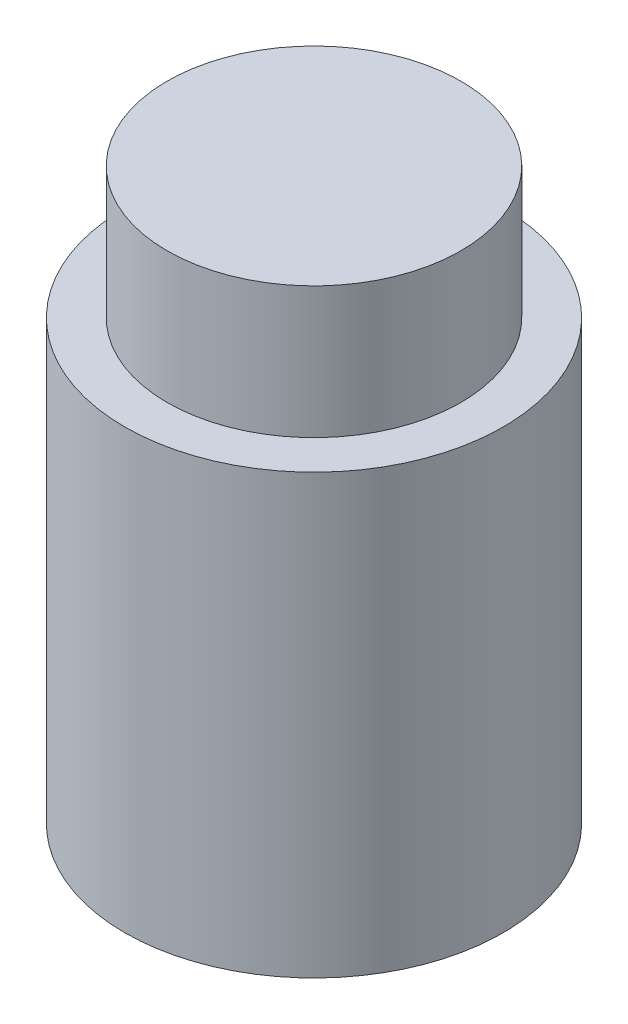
ISO-10303-21;
HEADER;
FILE_DESCRIPTION(('STEP AP214'),'2;1');
FILE_NAME('part.step','',(''),(''),'','','');
FILE_SCHEMA(('AUTOMOTIVE_DESIGN { 1 0 10303 214 1 1 1 1 }'));
ENDSEC;
DATA;
#1=APPLICATION_CONTEXT('core data for automotive mechanical design processes');
#2=APPLICATION_PROTOCOL_DEFINITION('international standard','automotive_design',2000,#1);
#3=PRODUCT_CONTEXT('',#1,'mechanical');
#4=PRODUCT('Part','Part','',(#3));
#5=PRODUCT_RELATED_PRODUCT_CATEGORY('part','',(#4));
#6=PRODUCT_DEFINITION_FORMATION('','',#4);
#7=PRODUCT_DEFINITION_CONTEXT('part definition',#1,'design');
#8=PRODUCT_DEFINITION('design','',#6,#7);
#9=PRODUCT_DEFINITION_SHAPE('','',#8);
#10=(LENGTH_UNIT() NAMED_UNIT(*) SI_UNIT(.MILLI.,.METRE.));
#11=(NAMED_UNIT(*) PLANE_ANGLE_UNIT() SI_UNIT($,.RADIAN.));
#12=(NAMED_UNIT(*) SI_UNIT($,.STERADIAN.) SOLID_ANGLE_UNIT());
#13=UNCERTAINTY_MEASURE_WITH_UNIT(LENGTH_MEASURE(1.E-05),#10,'distance_accuracy_value','');
#14=(GEOMETRIC_REPRESENTATION_CONTEXT(3) GLOBAL_UNCERTAINTY_ASSIGNED_CONTEXT((#13)) GLOBAL_UNIT_ASSIGNED_CONTEXT((#10,
#11,#12)) REPRESENTATION_CONTEXT('',''));
#15=CARTESIAN_POINT('',(0.,0.,0.));
#16=DIRECTION('',(0.,0.,1.));
#17=DIRECTION('',(1.,0.,0.));
#18=AXIS2_PLACEMENT_3D('',#15,#16,#17);
#19=CARTESIAN_POINT('',(0.,25.,0.));
#20=DIRECTION('',(0.,-1.,0.));
#21=DIRECTION('',(0.,0.,-1.));
#22=AXIS2_PLACEMENT_3D('',#19,#20,#21);
#23=CYLINDRICAL_SURFACE('',#22,10.8);
#24=CARTESIAN_POINT('',(0.,25.,0.));
#25=DIRECTION('',(0.,1.,0.));
#26=DIRECTION('',(0.,0.,1.));
#27=AXIS2_PLACEMENT_3D('',#24,#25,#26);
#28=CIRCLE('',#27,10.8);
#29=CARTESIAN_POINT('',(0.,25.,10.8));
#30=VERTEX_POINT('',#29);
#31=EDGE_CURVE('E10',#30,#30,#28,.T.);
#32=ORIENTED_EDGE('',*,*,#31,.F.);
#33=EDGE_LOOP('',(#32));
#34=FACE_BOUND('',#33,.T.);
#35=CARTESIAN_POINT('',(0.,0.,0.));
#36=DIRECTION('',(0.,1.,0.));
#37=DIRECTION('',(0.,0.,1.));
#38=AXIS2_PLACEMENT_3D('',#35,#36,#37);
#39=CIRCLE('',#38,10.8);
#40=CARTESIAN_POINT('',(0.,0.,10.8));
#41=VERTEX_POINT('',#40);
#42=EDGE_CURVE('E36',#41,#41,#39,.T.);
#43=ORIENTED_EDGE('',*,*,#42,.T.);
#44=EDGE_LOOP('',(#43));
#45=FACE_BOUND('',#44,.T.);
#46=ADVANCED_FACE('F33',(#34,#45),#23,.T.);
#47=CARTESIAN_POINT('',(0.,25.,0.));
#48=DIRECTION('',(0.,1.,0.));
#49=DIRECTION('',(0.,0.,1.));
#50=AXIS2_PLACEMENT_3D('',#47,#48,#49);
#51=PLANE('',#50);
#52=CARTESIAN_POINT('',(0.,25.,0.));
#53=DIRECTION('',(0.,1.,0.));
#54=DIRECTION('',(0.,0.,1.));
#55=AXIS2_PLACEMENT_3D('',#52,#53,#54);
#56=CIRCLE('',#55,8.38470738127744);
#57=CARTESIAN_POINT('',(0.,25.,8.38470738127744));
#58=VERTEX_POINT('',#57);
#59=EDGE_CURVE('E45',#58,#58,#56,.T.);
#60=ORIENTED_EDGE('',*,*,#59,.F.);
#61=EDGE_LOOP('',(#60));
#62=FACE_BOUND('',#61,.T.);
#63=ORIENTED_EDGE('',*,*,#31,.T.);
#64=EDGE_LOOP('',(#63));
#65=FACE_BOUND('',#64,.T.);
#66=ADVANCED_FACE('F60',(#62,#65),#51,.T.);
#67=CARTESIAN_POINT('',(0.,0.,0.));
#68=DIRECTION('',(0.,1.,0.));
#69=DIRECTION('',(0.,0.,1.));
#70=AXIS2_PLACEMENT_3D('',#67,#68,#69);
#71=PLANE('',#70);
#72=ORIENTED_EDGE('',*,*,#42,.F.);
#73=EDGE_LOOP('',(#72));
#74=FACE_BOUND('',#73,.T.);
#75=ADVANCED_FACE('F56',(#74),#71,.F.);
#76=CARTESIAN_POINT('',(0.,32.5,0.));
#77=DIRECTION('',(0.,-1.,0.));
#78=DIRECTION('',(0.,0.,-1.));
#79=AXIS2_PLACEMENT_3D('',#76,#77,#78);
#80=CYLINDRICAL_SURFACE('',#79,8.38470738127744);
#81=CARTESIAN_POINT('',(0.,32.5,0.));
#82=DIRECTION('',(0.,1.,0.));
#83=DIRECTION('',(0.,0.,1.));
#84=AXIS2_PLACEMENT_3D('',#81,#82,#83);
#85=CIRCLE('',#84,8.38470738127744);
#86=CARTESIAN_POINT('',(0.,32.5,8.38470738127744));
#87=VERTEX_POINT('',#86);
#88=EDGE_CURVE('E43',#87,#87,#85,.T.);
#89=ORIENTED_EDGE('',*,*,#88,.F.);
#90=EDGE_LOOP('',(#89));
#91=FACE_BOUND('',#90,.T.);
#92=ORIENTED_EDGE('',*,*,#59,.T.);
#93=EDGE_LOOP('',(#92));
#94=FACE_BOUND('',#93,.T.);
#95=ADVANCED_FACE('F53',(#91,#94),#80,.T.);
#96=CARTESIAN_POINT('',(0.,32.5,0.));
#97=DIRECTION('',(0.,1.,0.));
#98=DIRECTION('',(0.,0.,1.));
#99=AXIS2_PLACEMENT_3D('',#96,#97,#98);
#100=PLANE('',#99);
#101=ORIENTED_EDGE('',*,*,#88,.T.);
#102=EDGE_LOOP('',(#101));
#103=FACE_BOUND('',#102,.T.);
#104=ADVANCED_FACE('F51',(#103),#100,.T.);
#105=CLOSED_SHELL('',(#46,#66,#75,#95,#104));
#106=MANIFOLD_SOLID_BREP('B2',#105);
#107=ADVANCED_BREP_SHAPE_REPRESENTATION('',(#18,#106),#14);
#108=SHAPE_DEFINITION_REPRESENTATION(#9,#107);
ENDSEC;
END-ISO-10303-21;
